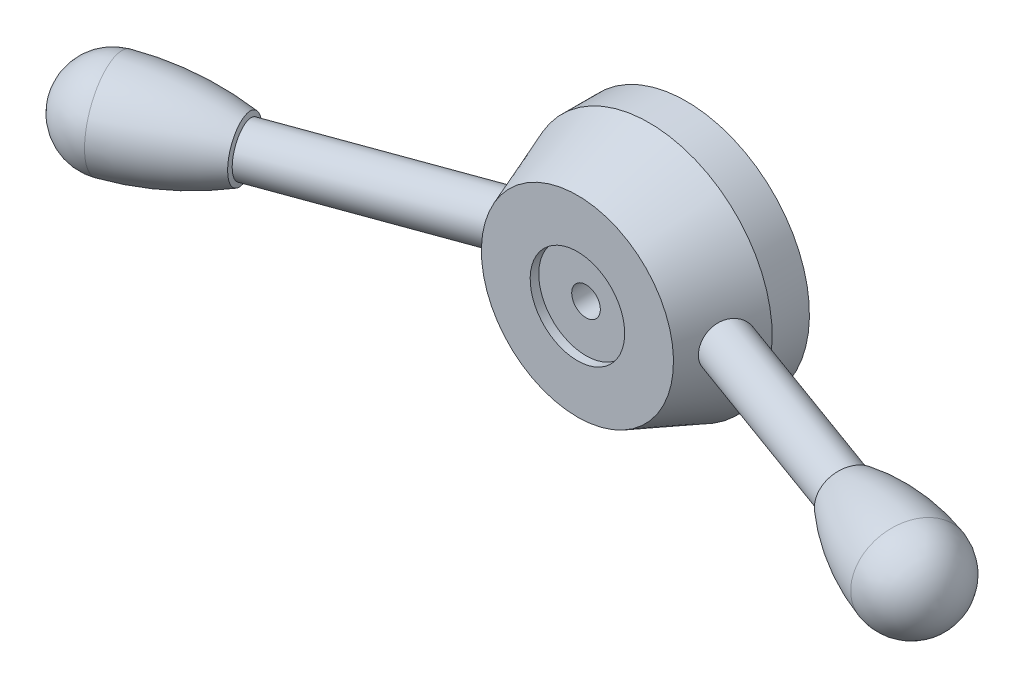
ISO-10303-21;
HEADER;
FILE_DESCRIPTION(('STEP AP214'),'2;1');
FILE_NAME('part.step','',(''),(''),'','','');
FILE_SCHEMA(('AUTOMOTIVE_DESIGN { 1 0 10303 214 1 1 1 1 }'));
ENDSEC;
DATA;
#1=APPLICATION_CONTEXT('core data for automotive mechanical design processes');
#2=APPLICATION_PROTOCOL_DEFINITION('international standard','automotive_design',2000,#1);
#3=PRODUCT_CONTEXT('',#1,'mechanical');
#4=PRODUCT('Part','Part','',(#3));
#5=PRODUCT_RELATED_PRODUCT_CATEGORY('part','',(#4));
#6=PRODUCT_DEFINITION_FORMATION('','',#4);
#7=PRODUCT_DEFINITION_CONTEXT('part definition',#1,'design');
#8=PRODUCT_DEFINITION('design','',#6,#7);
#9=PRODUCT_DEFINITION_SHAPE('','',#8);
#10=(LENGTH_UNIT() NAMED_UNIT(*) SI_UNIT(.MILLI.,.METRE.));
#11=(NAMED_UNIT(*) PLANE_ANGLE_UNIT() SI_UNIT($,.RADIAN.));
#12=(NAMED_UNIT(*) SI_UNIT($,.STERADIAN.) SOLID_ANGLE_UNIT());
#13=UNCERTAINTY_MEASURE_WITH_UNIT(LENGTH_MEASURE(1.E-05),#10,'distance_accuracy_value','');
#14=(GEOMETRIC_REPRESENTATION_CONTEXT(3) GLOBAL_UNCERTAINTY_ASSIGNED_CONTEXT((#13)) GLOBAL_UNIT_ASSIGNED_CONTEXT((#10,
#11,#12)) REPRESENTATION_CONTEXT('',''));
#15=CARTESIAN_POINT('',(0.,0.,0.));
#16=DIRECTION('',(0.,0.,1.));
#17=DIRECTION('',(1.,0.,0.));
#18=AXIS2_PLACEMENT_3D('',#15,#16,#17);
#19=CARTESIAN_POINT('',(0.,0.,16.));
#20=DIRECTION('',(0.,0.,-1.));
#21=DIRECTION('',(0.,1.,0.));
#22=AXIS2_PLACEMENT_3D('',#19,#20,#21);
#23=CONICAL_SURFACE('',#22,43.,0.361861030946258);
#24=CARTESIAN_POINT('',(40.556704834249,5.3394046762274,21.5301733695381));
#25=CARTESIAN_POINT('',(40.4836805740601,5.5071618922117,21.6635939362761));
#26=CARTESIAN_POINT('',(40.40788440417,5.6684953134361,21.803487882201));
#27=CARTESIAN_POINT('',(40.2516139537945,5.97734896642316,22.0954888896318));
#28=CARTESIAN_POINT('',(40.1711388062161,6.12486662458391,22.2475982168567));
#29=CARTESIAN_POINT('',(40.0064352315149,6.40509835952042,22.5631891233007));
#30=CARTESIAN_POINT('',(39.9222045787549,6.53780349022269,22.7266774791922));
#31=CARTESIAN_POINT('',(39.7509783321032,6.78743379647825,23.064042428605));
#32=CARTESIAN_POINT('',(39.663981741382,6.90435320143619,23.2379227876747));
#33=CARTESIAN_POINT('',(39.4882680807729,7.12148405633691,23.5949172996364));
#34=CARTESIAN_POINT('',(39.3995515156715,7.22170032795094,23.7780287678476));
#35=CARTESIAN_POINT('',(39.2213183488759,7.40476857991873,24.1524882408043));
#36=CARTESIAN_POINT('',(39.131801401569,7.48761263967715,24.3438399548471));
#37=CARTESIAN_POINT('',(38.9529989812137,7.63522668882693,24.7334362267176));
#38=CARTESIAN_POINT('',(38.8637134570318,7.7000010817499,24.9316790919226));
#39=CARTESIAN_POINT('',(38.6863291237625,7.81096110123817,25.333701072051));
#40=CARTESIAN_POINT('',(38.5982297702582,7.85715555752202,25.5374775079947));
#41=CARTESIAN_POINT('',(38.424873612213,7.93027225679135,25.9473360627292));
#42=CARTESIAN_POINT('',(38.339597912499,7.95737095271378,26.1533787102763));
#43=CARTESIAN_POINT('',(38.1718566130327,7.99275336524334,26.5681165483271));
#44=CARTESIAN_POINT('',(38.0893899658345,8.00104417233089,26.7768107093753));
#45=CARTESIAN_POINT('',(37.9279284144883,7.99874569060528,27.1954661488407));
#46=CARTESIAN_POINT('',(37.8489339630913,7.98815394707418,27.4054275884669));
#47=CARTESIAN_POINT('',(37.6950350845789,7.94815316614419,27.8250555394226));
#48=CARTESIAN_POINT('',(37.6201306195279,7.91874430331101,28.03472205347));
#49=CARTESIAN_POINT('',(37.4760058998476,7.84191781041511,28.4490403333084));
#50=CARTESIAN_POINT('',(37.4067168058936,7.79477929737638,28.6537199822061));
#51=CARTESIAN_POINT('',(37.2729230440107,7.68279977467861,29.0598573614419));
#52=CARTESIAN_POINT('',(37.2084200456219,7.61795262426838,29.2613139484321));
#53=CARTESIAN_POINT('',(37.0844940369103,7.47107254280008,29.6593839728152));
#54=CARTESIAN_POINT('',(37.0250693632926,7.38904526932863,29.8559989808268));
#55=CARTESIAN_POINT('',(36.9113939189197,7.20836471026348,30.2430740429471));
#56=CARTESIAN_POINT('',(36.8571449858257,7.10970555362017,30.4335318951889));
#57=CARTESIAN_POINT('',(36.7536280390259,6.89597157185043,30.8077261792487));
#58=CARTESIAN_POINT('',(36.7043856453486,6.78081892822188,30.9914252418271));
#59=CARTESIAN_POINT('',(36.6111286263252,6.53527913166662,31.3497452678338));
#60=CARTESIAN_POINT('',(36.5671140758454,6.40489176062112,31.5243661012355));
#61=CARTESIAN_POINT('',(36.4841688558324,6.12975103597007,31.8632593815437));
#62=CARTESIAN_POINT('',(36.4452394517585,5.98499412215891,32.0275292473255));
#63=CARTESIAN_POINT('',(36.3722926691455,5.68216817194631,32.3443790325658));
#64=CARTESIAN_POINT('',(36.338273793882,5.52410321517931,32.496962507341));
#65=CARTESIAN_POINT('',(36.2743543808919,5.19288009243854,32.7918078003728));
#66=CARTESIAN_POINT('',(36.2445336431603,5.01951110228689,32.9338501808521));
#67=CARTESIAN_POINT('',(36.1894274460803,4.66123567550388,33.2035297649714));
#68=CARTESIAN_POINT('',(36.1641419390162,4.47632936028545,33.3311671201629));
#69=CARTESIAN_POINT('',(36.1178107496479,4.09623111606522,33.5709744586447));
#70=CARTESIAN_POINT('',(36.096765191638,3.90103888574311,33.683143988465));
#71=CARTESIAN_POINT('',(36.0586258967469,3.50172003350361,33.8910380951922));
#72=CARTESIAN_POINT('',(36.0415320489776,3.29759366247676,33.9867631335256));
#73=CARTESIAN_POINT('',(36.0110129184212,2.88164823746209,34.1609885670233));
#74=CARTESIAN_POINT('',(35.997590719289,2.66982288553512,34.2394744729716));
#75=CARTESIAN_POINT('',(35.9742012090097,2.24022382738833,34.3783665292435));
#76=CARTESIAN_POINT('',(35.9642326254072,2.02245234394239,34.4387793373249));
#77=CARTESIAN_POINT('',(35.9475510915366,1.58244164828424,34.5409918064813));
#78=CARTESIAN_POINT('',(35.9408384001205,1.36020208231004,34.5827899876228));
#79=CARTESIAN_POINT('',(35.9305323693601,0.912904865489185,34.6473570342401));
#80=CARTESIAN_POINT('',(35.9269389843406,0.687847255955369,34.6701261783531));
#81=CARTESIAN_POINT('',(35.9228297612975,0.240377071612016,34.6961895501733));
#82=CARTESIAN_POINT('',(35.9222632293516,0.0179835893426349,34.6998045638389));
#83=CARTESIAN_POINT('',(35.9240599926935,-0.4263906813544,34.6883859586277));
#84=CARTESIAN_POINT('',(35.9264243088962,-0.648371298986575,34.6733458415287));
#85=CARTESIAN_POINT('',(35.9341321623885,-1.09015708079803,34.6247602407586));
#86=CARTESIAN_POINT('',(35.9394745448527,-1.30996305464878,34.5912219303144));
#87=CARTESIAN_POINT('',(35.9532480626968,-1.7460011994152,34.5059482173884));
#88=CARTESIAN_POINT('',(35.9616803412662,-1.96223201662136,34.4542060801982));
#89=CARTESIAN_POINT('',(35.9817426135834,-2.38840285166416,34.3333254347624));
#90=CARTESIAN_POINT('',(35.9933557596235,-2.59836972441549,34.2642787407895));
#91=CARTESIAN_POINT('',(36.0200031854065,-3.01174776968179,34.109275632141));
#92=CARTESIAN_POINT('',(36.0350375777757,-3.21515872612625,34.0233186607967));
#93=CARTESIAN_POINT('',(36.0687683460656,-3.61406209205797,33.835239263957));
#94=CARTESIAN_POINT('',(36.0874649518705,-3.80955400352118,33.7331158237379));
#95=CARTESIAN_POINT('',(36.1287840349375,-4.19131335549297,33.5135669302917));
#96=CARTESIAN_POINT('',(36.1514065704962,-4.37758065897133,33.3961412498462));
#97=CARTESIAN_POINT('',(36.2012307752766,-4.74243311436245,33.1450425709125));
#98=CARTESIAN_POINT('',(36.2284970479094,-4.92085768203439,33.0111490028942));
#99=CARTESIAN_POINT('',(36.2876452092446,-5.26573488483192,32.7296701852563));
#100=CARTESIAN_POINT('',(36.3195270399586,-5.4321876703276,32.5820851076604));
#101=CARTESIAN_POINT('',(36.388180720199,-5.7520394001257,32.2743563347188));
#102=CARTESIAN_POINT('',(36.4249537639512,-5.90543514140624,32.114209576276));
#103=CARTESIAN_POINT('',(36.503598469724,-6.19802566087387,31.7826960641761));
#104=CARTESIAN_POINT('',(36.5454683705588,-6.33722531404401,31.6113331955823));
#105=CARTESIAN_POINT('',(36.6349189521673,-6.60178118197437,31.2569564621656));
#106=CARTESIAN_POINT('',(36.6825507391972,-6.72699119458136,31.0738462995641));
#107=CARTESIAN_POINT('',(36.7832998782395,-6.96109057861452,30.6989115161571));
#108=CARTESIAN_POINT('',(36.8364171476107,-7.06998019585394,30.507087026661));
#109=CARTESIAN_POINT('',(36.9481438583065,-7.27061966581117,30.1162218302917));
#110=CARTESIAN_POINT('',(37.0067529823,-7.36237050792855,29.9171815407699));
#111=CARTESIAN_POINT('',(37.1293655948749,-7.52803258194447,29.5134244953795));
#112=CARTESIAN_POINT('',(37.1933688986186,-7.60194442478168,29.3087079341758));
#113=CARTESIAN_POINT('',(37.3257292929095,-7.73055286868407,28.8977381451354));
#114=CARTESIAN_POINT('',(37.3940227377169,-7.7854758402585,28.6915352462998));
#115=CARTESIAN_POINT('',(37.5353059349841,-7.87692113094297,28.2767598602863));
#116=CARTESIAN_POINT('',(37.6082939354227,-7.91345027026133,28.0681882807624));
#117=CARTESIAN_POINT('',(37.7585502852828,-7.96786327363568,27.6501302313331));
#118=CARTESIAN_POINT('',(37.8358191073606,-7.9857450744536,27.440643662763));
#119=CARTESIAN_POINT('',(37.9940695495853,-8.00272931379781,27.0223138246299));
#120=CARTESIAN_POINT('',(38.0750511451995,-8.00183187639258,26.8134705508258));
#121=CARTESIAN_POINT('',(38.2389665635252,-7.98142087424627,26.4006866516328));
#122=CARTESIAN_POINT('',(38.3218601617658,-7.96215476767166,26.1967177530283));
#123=CARTESIAN_POINT('',(38.4899229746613,-7.90552231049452,25.7921766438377));
#124=CARTESIAN_POINT('',(38.5750929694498,-7.86814967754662,25.5916056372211));
#125=CARTESIAN_POINT('',(38.7468604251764,-7.77561699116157,25.1953161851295));
#126=CARTESIAN_POINT('',(38.8334574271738,-7.72046255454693,24.9995962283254));
#127=CARTESIAN_POINT('',(39.0072899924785,-7.59276466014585,24.6141183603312));
#128=CARTESIAN_POINT('',(39.0945257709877,-7.52021505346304,24.4243625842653));
#129=CARTESIAN_POINT('',(39.2694007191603,-7.35764188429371,24.0505986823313));
#130=CARTESIAN_POINT('',(39.3570377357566,-7.26748657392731,23.8666468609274));
#131=CARTESIAN_POINT('',(39.5311043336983,-7.07072171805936,23.5071640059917));
#132=CARTESIAN_POINT('',(39.6175338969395,-6.96411192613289,23.3316330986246));
#133=CARTESIAN_POINT('',(39.78826780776,-6.73515855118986,22.9899844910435));
#134=CARTESIAN_POINT('',(39.8725716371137,-6.61281117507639,22.8238690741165));
#135=CARTESIAN_POINT('',(40.0380723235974,-6.35327877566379,22.5021050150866));
#136=CARTESIAN_POINT('',(40.1192701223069,-6.21609829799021,22.34645318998));
#137=CARTESIAN_POINT('',(40.2790259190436,-5.92531462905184,22.0438763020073));
#138=CARTESIAN_POINT('',(40.3575149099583,-5.77147045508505,21.8971463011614));
#139=CARTESIAN_POINT('',(40.5094192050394,-5.45040136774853,21.6162408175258));
#140=CARTESIAN_POINT('',(40.5828345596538,-5.28317658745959,21.4820652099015));
#141=CARTESIAN_POINT('',(40.7237001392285,-4.93647363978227,21.2270568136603));
#142=CARTESIAN_POINT('',(40.791150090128,-4.75699491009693,21.1062246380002));
#143=CARTESIAN_POINT('',(40.9192368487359,-4.38702092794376,20.8786430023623));
#144=CARTESIAN_POINT('',(40.9798738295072,-4.19652595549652,20.7718931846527));
#145=CARTESIAN_POINT('',(41.0936735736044,-3.8054423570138,20.5729357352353));
#146=CARTESIAN_POINT('',(41.146821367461,-3.60483457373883,20.4807571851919));
#147=CARTESIAN_POINT('',(41.2447846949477,-3.19535424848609,20.3118139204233));
#148=CARTESIAN_POINT('',(41.2896032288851,-2.98648471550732,20.2350436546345));
#149=CARTESIAN_POINT('',(41.3703336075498,-2.56188580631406,20.0973716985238));
#150=CARTESIAN_POINT('',(41.406244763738,-2.34615590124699,20.0364712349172));
#151=CARTESIAN_POINT('',(41.4686641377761,-1.90941788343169,19.9309557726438));
#152=CARTESIAN_POINT('',(41.4951724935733,-1.68840984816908,19.8863405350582));
#153=CARTESIAN_POINT('',(41.5380924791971,-1.24610286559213,19.8142478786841));
#154=CARTESIAN_POINT('',(41.5546502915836,-1.02485852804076,19.7865222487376));
#155=CARTESIAN_POINT('',(41.5780623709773,-0.580423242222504,19.7473511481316));
#156=CARTESIAN_POINT('',(41.5849166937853,-0.357232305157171,19.7359055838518));
#157=CARTESIAN_POINT('',(41.5888279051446,0.089496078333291,19.7293722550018));
#158=CARTESIAN_POINT('',(41.5858838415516,0.313033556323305,19.7342860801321));
#159=CARTESIAN_POINT('',(41.5702367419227,0.758804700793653,19.7604413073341));
#160=CARTESIAN_POINT('',(41.5575338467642,0.981038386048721,19.7816824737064));
#161=CARTESIAN_POINT('',(41.5227249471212,1.42030070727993,19.8400431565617));
#162=CARTESIAN_POINT('',(41.5007179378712,1.63735942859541,19.8769955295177));
#163=CARTESIAN_POINT('',(41.4476102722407,2.0670978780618,19.9665051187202));
#164=CARTESIAN_POINT('',(41.4165096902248,2.27977764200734,20.0190622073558));
#165=CARTESIAN_POINT('',(41.3456427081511,2.69915281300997,20.1394078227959));
#166=CARTESIAN_POINT('',(41.3058820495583,2.90585208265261,20.2071862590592));
#167=CARTESIAN_POINT('',(41.2182113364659,3.31194310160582,20.3575398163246));
#168=CARTESIAN_POINT('',(41.1703025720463,3.51133600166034,20.4401125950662));
#169=CARTESIAN_POINT('',(41.0405745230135,4.00095739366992,20.6653116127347));
#170=CARTESIAN_POINT('',(40.9539080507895,4.28575461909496,20.817110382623));
#171=CARTESIAN_POINT('',(40.7657326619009,4.83147855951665,21.1513188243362));
#172=CARTESIAN_POINT('',(40.6642233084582,5.09240457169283,21.3337293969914));
#173=CARTESIAN_POINT('',(40.556704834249,5.3394046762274,21.5301733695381));
#174=B_SPLINE_CURVE_WITH_KNOTS('',3,(#24,#25,#26,#27,#28,#29,#30,#31,#32,#33,#34,#35,#36,#37,
#38,#39,#40,#41,#42,#43,#44,#45,#46,#47,#48,#49,#50,#51,#52,#53,#54,#55,#56,#57,#58,#59,#60,#61,
#62,#63,#64,#65,#66,#67,#68,#69,#70,#71,#72,#73,#74,#75,#76,#77,#78,#79,#80,#81,#82,#83,#84,#85,
#86,#87,#88,#89,#90,#91,#92,#93,#94,#95,#96,#97,#98,#99,#100,#101,#102,#103,#104,#105,#106,#107,
#108,#109,#110,#111,#112,#113,#114,#115,#116,#117,#118,#119,#120,#121,#122,#123,#124,#125,#126,
#127,#128,#129,#130,#131,#132,#133,#134,#135,#136,#137,#138,#139,#140,#141,#142,#143,#144,#145,
#146,#147,#148,#149,#150,#151,#152,#153,#154,#155,#156,#157,#158,#159,#160,#161,#162,#163,#164,
#165,#166,#167,#168,#169,#170,#171,#172,#173),.UNSPECIFIED.,.T.,.F.,(4,2,2,2,2,2,2,2,2,2,2,2,2,
2,2,2,2,2,2,2,2,2,2,2,2,2,2,2,2,2,2,2,2,2,2,2,2,2,2,2,2,2,2,2,2,2,2,2,2,2,2,2,2,2,2,2,2,2,2,2,2,
2,2,2,2,2,2,2,2,2,2,2,2,2,4),(0.,0.679039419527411,1.35820508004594,2.03777873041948,
2.71760013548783,3.3972249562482,4.07715897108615,4.7569271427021,5.43637188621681,
6.10945288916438,6.78228010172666,7.45519478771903,8.12810323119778,8.79083369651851,
9.45379426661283,10.1165368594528,10.77951389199,11.4457288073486,12.1119532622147,
12.7783431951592,13.444529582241,14.1220356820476,14.7995346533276,15.4770534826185,
16.1545532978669,16.832620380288,17.5104373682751,18.1883082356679,18.8661691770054,
19.5326408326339,20.1993447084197,20.865790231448,21.532482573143,22.1957098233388,
22.858958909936,23.5222496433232,24.1855502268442,24.8589717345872,25.5323847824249,
26.2059625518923,26.8793082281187,27.5591374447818,28.2389564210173,28.9187361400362,
29.5984925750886,30.2698409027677,30.9409401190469,31.6121135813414,32.283282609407,
32.9455357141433,33.6080187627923,34.2702927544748,34.932801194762,35.6004717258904,
36.2681522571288,36.9359940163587,37.6036316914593,38.2827011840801,38.9617639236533,
39.6408578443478,40.3199345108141,41.0003498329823,41.6805195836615,42.3607418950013,
43.0409542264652,43.7109124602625,44.3808668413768,45.05088632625,45.7208961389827,
46.3839497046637,47.0469978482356,47.7096077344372,48.3721128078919,49.3718782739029,
50.3716731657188),.UNSPECIFIED.);
#175=CARTESIAN_POINT('',(40.556704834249,5.3394046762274,21.5301733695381));
#176=VERTEX_POINT('',#175);
#177=EDGE_CURVE('E24',#176,#176,#174,.T.);
#178=ORIENTED_EDGE('',*,*,#177,.F.);
#179=EDGE_LOOP('',(#178));
#180=FACE_BOUND('',#179,.T.);
#181=CARTESIAN_POINT('',(0.,0.,41.));
#182=DIRECTION('',(0.,0.,1.));
#183=DIRECTION('',(0.,-1.,0.));
#184=AXIS2_PLACEMENT_3D('',#181,#182,#183);
#185=CIRCLE('',#184,33.5367739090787);
#186=CARTESIAN_POINT('',(0.,-33.5367739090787,41.));
#187=VERTEX_POINT('',#186);
#188=EDGE_CURVE('E105',#187,#187,#185,.T.);
#189=ORIENTED_EDGE('',*,*,#188,.F.);
#190=EDGE_LOOP('',(#189));
#191=FACE_BOUND('',#190,.T.);
#192=CARTESIAN_POINT('',(0.,0.,16.));
#193=DIRECTION('',(0.,0.,1.));
#194=DIRECTION('',(0.,-1.,0.));
#195=AXIS2_PLACEMENT_3D('',#192,#193,#194);
#196=CIRCLE('',#195,43.);
#197=CARTESIAN_POINT('',(0.,-43.,16.));
#198=VERTEX_POINT('',#197);
#199=EDGE_CURVE('E109',#198,#198,#196,.T.);
#200=ORIENTED_EDGE('',*,*,#199,.T.);
#201=EDGE_LOOP('',(#200));
#202=FACE_BOUND('',#201,.T.);
#203=CARTESIAN_POINT('',(-40.6109020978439,5.60848954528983,21.2932591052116));
#204=CARTESIAN_POINT('',(-40.6877675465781,5.43547274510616,21.1546371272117));
#205=CARTESIAN_POINT('',(-40.7617594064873,5.25590688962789,21.0226965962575));
#206=CARTESIAN_POINT('',(-40.9031561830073,4.88474613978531,20.772827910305));
#207=CARTESIAN_POINT('',(-40.9705601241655,4.69314947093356,20.6549018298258));
#208=CARTESIAN_POINT('',(-41.0979465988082,4.2991439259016,20.4337474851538));
#209=CARTESIAN_POINT('',(-41.1579245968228,4.09672854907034,20.3305281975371));
#210=CARTESIAN_POINT('',(-41.2696427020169,3.68256776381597,20.1395003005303));
#211=CARTESIAN_POINT('',(-41.3213829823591,3.47082255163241,20.0516913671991));
#212=CARTESIAN_POINT('',(-41.4159670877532,3.03936523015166,19.8920005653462));
#213=CARTESIAN_POINT('',(-41.458806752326,2.81964945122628,19.8201261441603));
#214=CARTESIAN_POINT('',(-41.5349832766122,2.37389185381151,19.6928228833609));
#215=CARTESIAN_POINT('',(-41.5683200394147,2.14784997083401,19.6373942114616));
#216=CARTESIAN_POINT('',(-41.6250271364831,1.69111334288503,19.543363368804));
#217=CARTESIAN_POINT('',(-41.6483995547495,1.46041958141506,19.5047576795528));
#218=CARTESIAN_POINT('',(-41.684862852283,0.996014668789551,19.4446192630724));
#219=CARTESIAN_POINT('',(-41.6979538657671,0.762303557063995,19.4230863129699));
#220=CARTESIAN_POINT('',(-41.713570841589,0.296578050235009,19.3974062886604));
#221=CARTESIAN_POINT('',(-41.7162296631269,0.0645801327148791,19.3930405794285));
#222=CARTESIAN_POINT('',(-41.7113113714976,-0.399099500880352,19.4011231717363));
#223=CARTESIAN_POINT('',(-41.7037305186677,-0.630781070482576,19.4135776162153));
#224=CARTESIAN_POINT('',(-41.6784328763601,-1.09202820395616,19.455222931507));
#225=CARTESIAN_POINT('',(-41.6607181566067,-1.32159419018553,19.4844103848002));
#226=CARTESIAN_POINT('',(-41.6153952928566,-1.77702488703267,19.5593245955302));
#227=CARTESIAN_POINT('',(-41.5877869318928,-2.00288951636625,19.6050517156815));
#228=CARTESIAN_POINT('',(-41.523204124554,-2.44824858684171,19.7124858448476));
#229=CARTESIAN_POINT('',(-41.4862751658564,-2.66776835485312,19.7741152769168));
#230=CARTESIAN_POINT('',(-41.4034712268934,-3.10005273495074,19.9130654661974));
#231=CARTESIAN_POINT('',(-41.357596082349,-3.31281722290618,19.9903865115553));
#232=CARTESIAN_POINT('',(-41.2574966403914,-3.73012500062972,20.1602300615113));
#233=CARTESIAN_POINT('',(-41.2032732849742,-3.93466921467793,20.2527508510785));
#234=CARTESIAN_POINT('',(-41.0871378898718,-4.33426914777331,20.4524750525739));
#235=CARTESIAN_POINT('',(-41.0252233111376,-4.52932170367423,20.5596833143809));
#236=CARTESIAN_POINT('',(-40.8935713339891,-4.9112314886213,20.7897224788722));
#237=CARTESIAN_POINT('',(-40.8237370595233,-5.09793689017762,20.9127500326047));
#238=CARTESIAN_POINT('',(-40.6778255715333,-5.4589661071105,21.1725084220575));
#239=CARTESIAN_POINT('',(-40.6017482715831,-5.63328975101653,21.309239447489));
#240=CARTESIAN_POINT('',(-40.4442511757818,-5.96844082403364,21.5956517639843));
#241=CARTESIAN_POINT('',(-40.3628300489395,-6.12926486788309,21.7453362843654));
#242=CARTESIAN_POINT('',(-40.195652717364,-6.43624907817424,22.056722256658));
#243=CARTESIAN_POINT('',(-40.1098978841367,-6.58241384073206,22.218419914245));
#244=CARTESIAN_POINT('',(-39.9337349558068,-6.86119151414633,22.5554169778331));
#245=CARTESIAN_POINT('',(-39.8432769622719,-6.99357340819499,22.730881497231));
#246=CARTESIAN_POINT('',(-39.6599548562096,-7.24134623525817,23.0922375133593));
#247=CARTESIAN_POINT('',(-39.567090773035,-7.35673737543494,23.2781288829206));
#248=CARTESIAN_POINT('',(-39.3800185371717,-7.56969128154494,23.6592193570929));
#249=CARTESIAN_POINT('',(-39.285810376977,-7.66725394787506,23.8544185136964));
#250=CARTESIAN_POINT('',(-39.097108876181,-7.84381053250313,24.252903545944));
#251=CARTESIAN_POINT('',(-39.0026155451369,-7.92280506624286,24.4561891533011));
#252=CARTESIAN_POINT('',(-38.8148622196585,-8.06124622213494,24.8684638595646));
#253=CARTESIAN_POINT('',(-38.721598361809,-8.12079274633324,25.0774176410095));
#254=CARTESIAN_POINT('',(-38.536808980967,-8.22039818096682,25.5005761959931));
#255=CARTESIAN_POINT('',(-38.4452828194,-8.26046438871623,25.7147789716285));
#256=CARTESIAN_POINT('',(-38.264833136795,-8.32080239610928,26.1470535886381));
#257=CARTESIAN_POINT('',(-38.1759097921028,-8.34107285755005,26.3651256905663));
#258=CARTESIAN_POINT('',(-38.0014961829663,-8.36162638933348,26.8035718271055));
#259=CARTESIAN_POINT('',(-37.9160058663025,-8.36190976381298,27.0239458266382));
#260=CARTESIAN_POINT('',(-37.7507713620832,-8.34265218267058,27.4611666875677));
#261=CARTESIAN_POINT('',(-37.6709486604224,-8.3234893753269,27.6780006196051));
#262=CARTESIAN_POINT('',(-37.5158414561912,-8.26603504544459,28.1108427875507));
#263=CARTESIAN_POINT('',(-37.4405585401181,-8.22773687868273,28.3268507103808));
#264=CARTESIAN_POINT('',(-37.2950280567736,-8.13230773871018,28.7563311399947));
#265=CARTESIAN_POINT('',(-37.2247793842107,-8.07518091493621,28.9698041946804));
#266=CARTESIAN_POINT('',(-37.0896212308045,-7.9425255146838,29.3926897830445));
#267=CARTESIAN_POINT('',(-37.0247119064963,-7.86699639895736,29.6021021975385));
#268=CARTESIAN_POINT('',(-36.9007128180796,-7.6984869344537,30.0143752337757));
#269=CARTESIAN_POINT('',(-36.8415982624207,-7.60558636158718,30.2172610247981));
#270=CARTESIAN_POINT('',(-36.7289380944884,-7.40279425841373,30.6159655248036));
#271=CARTESIAN_POINT('',(-36.6753925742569,-7.29290244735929,30.8117841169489));
#272=CARTESIAN_POINT('',(-36.5738401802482,-7.05690456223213,31.1949207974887));
#273=CARTESIAN_POINT('',(-36.5258337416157,-6.93079721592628,31.3822382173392));
#274=CARTESIAN_POINT('',(-36.4352440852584,-6.66324902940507,31.7469733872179));
#275=CARTESIAN_POINT('',(-36.392660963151,-6.52180791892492,31.9243909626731));
#276=CARTESIAN_POINT('',(-36.3120500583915,-6.22204281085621,32.2708997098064));
#277=CARTESIAN_POINT('',(-36.2741110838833,-6.06347457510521,32.4398003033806));
#278=CARTESIAN_POINT('',(-36.2033750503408,-5.73255795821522,32.764678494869));
#279=CARTESIAN_POINT('',(-36.1705779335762,-5.56020973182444,32.9206562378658));
#280=CARTESIAN_POINT('',(-36.1098149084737,-5.20287298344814,33.2184668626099));
#281=CARTESIAN_POINT('',(-36.0818494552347,-5.01788327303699,33.3602984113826));
#282=CARTESIAN_POINT('',(-36.0304252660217,-4.63652057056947,33.6286386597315));
#283=CARTESIAN_POINT('',(-36.0069664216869,-4.44014785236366,33.7551477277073));
#284=CARTESIAN_POINT('',(-35.9639909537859,-4.03515401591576,33.9930601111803));
#285=CARTESIAN_POINT('',(-35.9445196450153,-3.82642351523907,34.1042855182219));
#286=CARTESIAN_POINT('',(-35.9095180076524,-3.40019634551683,34.3089654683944));
#287=CARTESIAN_POINT('',(-35.8939862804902,-3.18270281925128,34.4024263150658));
#288=CARTESIAN_POINT('',(-35.8665550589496,-2.74039282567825,34.5707689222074));
#289=CARTESIAN_POINT('',(-35.854655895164,-2.51557569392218,34.6456489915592));
#290=CARTESIAN_POINT('',(-35.8342383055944,-2.06025748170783,34.7760996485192));
#291=CARTESIAN_POINT('',(-35.8257198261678,-1.82975649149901,34.8316705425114));
#292=CARTESIAN_POINT('',(-35.8119619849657,-1.3679496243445,34.9223292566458));
#293=CARTESIAN_POINT('',(-35.8066792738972,-1.1366980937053,34.9576874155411));
#294=CARTESIAN_POINT('',(-35.7990860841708,-0.67198702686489,35.0087402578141));
#295=CARTESIAN_POINT('',(-35.7967755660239,-0.438527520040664,35.0244352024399));
#296=CARTESIAN_POINT('',(-35.7950702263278,0.0288746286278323,35.0360054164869));
#297=CARTESIAN_POINT('',(-35.7956751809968,0.262817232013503,35.0318822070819));
#298=CARTESIAN_POINT('',(-35.7998151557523,0.729487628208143,35.0038606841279));
#299=CARTESIAN_POINT('',(-35.8033501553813,0.962215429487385,34.9799625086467));
#300=CARTESIAN_POINT('',(-35.8133629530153,1.42141890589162,34.9131151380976));
#301=CARTESIAN_POINT('',(-35.8197975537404,1.64793633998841,34.8704458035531));
#302=CARTESIAN_POINT('',(-35.8357440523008,2.09663497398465,34.7665163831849));
#303=CARTESIAN_POINT('',(-35.845256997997,2.31881466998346,34.7052499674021));
#304=CARTESIAN_POINT('',(-35.8675597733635,2.75719749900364,34.5647072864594));
#305=CARTESIAN_POINT('',(-35.880349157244,2.97340144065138,34.4854334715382));
#306=CARTESIAN_POINT('',(-35.9094548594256,3.39841262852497,34.3095783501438));
#307=CARTESIAN_POINT('',(-35.9257713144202,3.60721958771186,34.2129963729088));
#308=CARTESIAN_POINT('',(-35.9623951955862,4.018057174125,34.0023300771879));
#309=CARTESIAN_POINT('',(-35.9827402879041,4.220000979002,33.8880829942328));
#310=CARTESIAN_POINT('',(-36.0276349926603,4.6135879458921,33.6437611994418));
#311=CARTESIAN_POINT('',(-36.0521847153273,4.80523083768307,33.5136860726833));
#312=CARTESIAN_POINT('',(-36.1058164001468,5.17696533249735,33.2387657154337));
#313=CARTESIAN_POINT('',(-36.1348987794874,5.35705587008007,33.0939191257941));
#314=CARTESIAN_POINT('',(-36.197911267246,5.70448041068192,32.7906197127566));
#315=CARTESIAN_POINT('',(-36.2318414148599,5.87181431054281,32.6321667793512));
#316=CARTESIAN_POINT('',(-36.3054671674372,6.19536736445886,32.300058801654));
#317=CARTESIAN_POINT('',(-36.3452517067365,6.35134655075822,32.126189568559));
#318=CARTESIAN_POINT('',(-36.4303945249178,6.64786143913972,31.7670246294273));
#319=CARTESIAN_POINT('',(-36.4757527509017,6.78839728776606,31.5817290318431));
#320=CARTESIAN_POINT('',(-36.5722315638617,7.05301977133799,31.2011585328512));
#321=CARTESIAN_POINT('',(-36.6233521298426,7.17710646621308,31.0058836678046));
#322=CARTESIAN_POINT('',(-36.7314524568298,7.40791067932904,30.6068809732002));
#323=CARTESIAN_POINT('',(-36.7884319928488,7.51462886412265,30.4031534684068));
#324=CARTESIAN_POINT('',(-36.9079638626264,7.70943699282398,29.9897851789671));
#325=CARTESIAN_POINT('',(-36.9704890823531,7.79761115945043,29.7801762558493));
#326=CARTESIAN_POINT('',(-37.1011823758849,7.95524411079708,29.3558367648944));
#327=CARTESIAN_POINT('',(-37.1693483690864,8.02470975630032,29.1411081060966));
#328=CARTESIAN_POINT('',(-37.3110858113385,8.1444262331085,28.7080926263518));
#329=CARTESIAN_POINT('',(-37.3846575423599,8.19467606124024,28.4898056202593));
#330=CARTESIAN_POINT('',(-37.5368072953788,8.27555981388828,28.0513514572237));
#331=CARTESIAN_POINT('',(-37.6153852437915,8.30619402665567,27.8311843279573));
#332=CARTESIAN_POINT('',(-37.7755249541,8.34723061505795,27.3947009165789));
#333=CARTESIAN_POINT('',(-37.8570047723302,8.35799630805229,27.1783886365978));
#334=CARTESIAN_POINT('',(-38.0236636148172,8.36034004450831,26.747088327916));
#335=CARTESIAN_POINT('',(-38.1088426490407,8.35191803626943,26.5321003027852));
#336=CARTESIAN_POINT('',(-38.2821926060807,8.31597078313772,26.104914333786));
#337=CARTESIAN_POINT('',(-38.3703639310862,8.2884429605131,25.89271677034));
#338=CARTESIAN_POINT('',(-38.5488816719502,8.21451644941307,25.4725698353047));
#339=CARTESIAN_POINT('',(-38.6392280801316,8.16811782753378,25.2646204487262));
#340=CARTESIAN_POINT('',(-38.8211530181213,8.05686334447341,24.8544737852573));
#341=CARTESIAN_POINT('',(-38.9127305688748,7.99202140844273,24.6522722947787));
#342=CARTESIAN_POINT('',(-39.0962595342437,7.84436390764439,24.2547228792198));
#343=CARTESIAN_POINT('',(-39.1882109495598,7.76154830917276,24.0593749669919));
#344=CARTESIAN_POINT('',(-39.3714840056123,7.57859397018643,23.6768060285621));
#345=CARTESIAN_POINT('',(-39.4628059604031,7.47846463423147,23.4895806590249));
#346=CARTESIAN_POINT('',(-39.6438689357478,7.26159934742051,23.1242870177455));
#347=CARTESIAN_POINT('',(-39.7336101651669,7.14486560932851,22.9462175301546));
#348=CARTESIAN_POINT('',(-39.962471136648,6.82239918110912,22.4986899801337));
#349=CARTESIAN_POINT('',(-40.0997041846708,6.604603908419,22.2368385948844));
#350=CARTESIAN_POINT('',(-40.3639264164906,6.13268900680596,21.742317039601));
#351=CARTESIAN_POINT('',(-40.4909153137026,5.878568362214,21.5096476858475));
#352=CARTESIAN_POINT('',(-40.6109020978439,5.60848954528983,21.2932591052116));
#353=B_SPLINE_CURVE_WITH_KNOTS('',3,(#203,#204,#205,#206,#207,#208,#209,#210,#211,#212,#213,
#214,#215,#216,#217,#218,#219,#220,#221,#222,#223,#224,#225,#226,#227,#228,#229,#230,#231,#232,
#233,#234,#235,#236,#237,#238,#239,#240,#241,#242,#243,#244,#245,#246,#247,#248,#249,#250,#251,
#252,#253,#254,#255,#256,#257,#258,#259,#260,#261,#262,#263,#264,#265,#266,#267,#268,#269,#270,
#271,#272,#273,#274,#275,#276,#277,#278,#279,#280,#281,#282,#283,#284,#285,#286,#287,#288,#289,
#290,#291,#292,#293,#294,#295,#296,#297,#298,#299,#300,#301,#302,#303,#304,#305,#306,#307,#308,
#309,#310,#311,#312,#313,#314,#315,#316,#317,#318,#319,#320,#321,#322,#323,#324,#325,#326,#327,
#328,#329,#330,#331,#332,#333,#334,#335,#336,#337,#338,#339,#340,#341,#342,#343,#344,#345,#346,
#347,#348,#349,#350,#351,#352),.UNSPECIFIED.,.T.,.F.,(4,2,2,2,2,2,2,2,2,2,2,2,2,2,2,2,2,2,2,2,2,
2,2,2,2,2,2,2,2,2,2,2,2,2,2,2,2,2,2,2,2,2,2,2,2,2,2,2,2,2,2,2,2,2,2,2,2,2,2,2,2,2,2,2,2,2,2,2,2,
2,2,2,2,2,4),(0.,0.70363324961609,1.4073705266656,2.11153552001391,2.81568570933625,
3.52016430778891,4.22465009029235,4.92898846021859,5.63331763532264,6.32864713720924,
7.02423065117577,7.71967215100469,8.41512890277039,9.10725508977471,9.79939398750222,
10.4914548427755,11.1837447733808,11.8856690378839,12.5876030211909,13.2897125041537,
13.9916011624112,14.7038162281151,15.4160226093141,16.1282329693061,16.8404197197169,
17.5488883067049,18.2570912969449,18.9653421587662,19.6735822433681,20.3683089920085,
21.0632771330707,21.7580922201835,22.4529276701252,23.144647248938,23.8363782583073,
24.5281635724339,25.2199610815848,25.9234108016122,26.6268526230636,27.3303606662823,
28.0338517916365,28.7449410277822,29.455777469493,30.1666785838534,30.8775684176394,
31.5787134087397,32.2798490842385,32.9809309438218,33.6820079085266,34.3729691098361,
35.0641657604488,35.7552684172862,36.4463978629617,37.1443232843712,37.8422670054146,
38.5402750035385,39.2382886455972,39.948278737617,40.6582620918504,41.3682428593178,
42.0781963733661,42.784852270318,43.4912486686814,44.1976819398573,44.9041048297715,
45.5974769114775,46.2908508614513,46.9843183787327,47.6777834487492,48.3707263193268,
49.0636704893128,49.7562394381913,50.4487161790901,51.5470553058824,52.6454251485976),.UNSPECIFIED.);
#354=CARTESIAN_POINT('',(-40.6109020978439,5.60848954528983,21.2932591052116));
#355=VERTEX_POINT('',#354);
#356=EDGE_CURVE('E8',#355,#355,#353,.T.);
#357=ORIENTED_EDGE('',*,*,#356,.F.);
#358=EDGE_LOOP('',(#357));
#359=FACE_BOUND('',#358,.T.);
#360=ADVANCED_FACE('F12',(#180,#191,#202,#359),#23,.T.);
#361=CARTESIAN_POINT('',(0.,0.,67.6284115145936));
#362=DIRECTION('',(0.,0.,1.));
#363=DIRECTION('',(0.,-1.,0.));
#364=AXIS2_PLACEMENT_3D('',#361,#362,#363);
#365=CYLINDRICAL_SURFACE('',#364,17.5);
#366=CARTESIAN_POINT('',(0.,0.,3.));
#367=DIRECTION('',(0.,0.,1.));
#368=DIRECTION('',(0.,-1.,0.));
#369=AXIS2_PLACEMENT_3D('',#366,#367,#368);
#370=CIRCLE('',#369,17.5);
#371=CARTESIAN_POINT('',(0.,-17.5,3.));
#372=VERTEX_POINT('',#371);
#373=EDGE_CURVE('E28',#372,#372,#370,.T.);
#374=ORIENTED_EDGE('',*,*,#373,.F.);
#375=EDGE_LOOP('',(#374));
#376=FACE_BOUND('',#375,.T.);
#377=CARTESIAN_POINT('',(0.,0.,1.));
#378=DIRECTION('',(0.,0.,1.));
#379=DIRECTION('',(0.,-1.,0.));
#380=AXIS2_PLACEMENT_3D('',#377,#378,#379);
#381=CIRCLE('',#380,17.5);
#382=CARTESIAN_POINT('',(0.,-17.5,1.));
#383=VERTEX_POINT('',#382);
#384=EDGE_CURVE('E129',#383,#383,#381,.T.);
#385=ORIENTED_EDGE('',*,*,#384,.T.);
#386=EDGE_LOOP('',(#385));
#387=FACE_BOUND('',#386,.T.);
#388=ADVANCED_FACE('F14',(#376,#387),#365,.T.);
#389=CARTESIAN_POINT('',(43.,0.,3.));
#390=DIRECTION('',(0.,0.,-1.));
#391=DIRECTION('',(0.,1.,0.));
#392=AXIS2_PLACEMENT_3D('',#389,#390,#391);
#393=PLANE('',#392);
#394=ORIENTED_EDGE('',*,*,#373,.T.);
#395=EDGE_LOOP('',(#394));
#396=FACE_BOUND('',#395,.T.);
#397=CARTESIAN_POINT('',(0.,0.,3.));
#398=DIRECTION('',(0.,0.,1.));
#399=DIRECTION('',(0.,-1.,0.));
#400=AXIS2_PLACEMENT_3D('',#397,#398,#399);
#401=CIRCLE('',#400,43.);
#402=CARTESIAN_POINT('',(0.,-43.,3.));
#403=VERTEX_POINT('',#402);
#404=EDGE_CURVE('E32',#403,#403,#401,.T.);
#405=ORIENTED_EDGE('',*,*,#404,.F.);
#406=EDGE_LOOP('',(#405));
#407=FACE_BOUND('',#406,.T.);
#408=ADVANCED_FACE('F90',(#396,#407),#393,.T.);
#409=CARTESIAN_POINT('',(0.,0.,67.6284115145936));
#410=DIRECTION('',(0.,0.,1.));
#411=DIRECTION('',(0.,-1.,0.));
#412=AXIS2_PLACEMENT_3D('',#409,#410,#411);
#413=CYLINDRICAL_SURFACE('',#412,43.);
#414=ORIENTED_EDGE('',*,*,#199,.F.);
#415=EDGE_LOOP('',(#414));
#416=FACE_BOUND('',#415,.T.);
#417=ORIENTED_EDGE('',*,*,#404,.T.);
#418=EDGE_LOOP('',(#417));
#419=FACE_BOUND('',#418,.T.);
#420=ADVANCED_FACE('F83',(#416,#419),#413,.T.);
#421=CARTESIAN_POINT('',(33.5367739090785,0.,41.));
#422=DIRECTION('',(0.,0.,-1.));
#423=DIRECTION('',(0.,1.,0.));
#424=AXIS2_PLACEMENT_3D('',#421,#422,#423);
#425=PLANE('',#424);
#426=CARTESIAN_POINT('',(0.,0.,41.));
#427=DIRECTION('',(0.,0.,1.));
#428=DIRECTION('',(0.,-1.,0.));
#429=AXIS2_PLACEMENT_3D('',#426,#427,#428);
#430=CIRCLE('',#429,16.5);
#431=CARTESIAN_POINT('',(0.,-16.5,41.));
#432=VERTEX_POINT('',#431);
#433=EDGE_CURVE('E112',#432,#432,#430,.T.);
#434=ORIENTED_EDGE('',*,*,#433,.F.);
#435=EDGE_LOOP('',(#434));
#436=FACE_BOUND('',#435,.T.);
#437=ORIENTED_EDGE('',*,*,#188,.T.);
#438=EDGE_LOOP('',(#437));
#439=FACE_BOUND('',#438,.T.);
#440=ADVANCED_FACE('F80',(#436,#439),#425,.F.);
#441=CARTESIAN_POINT('',(0.,0.,67.6284115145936));
#442=DIRECTION('',(0.,0.,1.));
#443=DIRECTION('',(0.,-1.,0.));
#444=AXIS2_PLACEMENT_3D('',#441,#442,#443);
#445=CYLINDRICAL_SURFACE('',#444,16.5);
#446=ORIENTED_EDGE('',*,*,#433,.T.);
#447=EDGE_LOOP('',(#446));
#448=FACE_BOUND('',#447,.T.);
#449=CARTESIAN_POINT('',(0.,0.,38.));
#450=DIRECTION('',(0.,0.,1.));
#451=DIRECTION('',(0.,-1.,0.));
#452=AXIS2_PLACEMENT_3D('',#449,#450,#451);
#453=CIRCLE('',#452,16.5);
#454=CARTESIAN_POINT('',(0.,-16.5,38.));
#455=VERTEX_POINT('',#454);
#456=EDGE_CURVE('E117',#455,#455,#453,.T.);
#457=ORIENTED_EDGE('',*,*,#456,.F.);
#458=EDGE_LOOP('',(#457));
#459=FACE_BOUND('',#458,.T.);
#460=ADVANCED_FACE('F77',(#448,#459),#445,.F.);
#461=CARTESIAN_POINT('',(16.5,0.,38.));
#462=DIRECTION('',(0.,0.,-1.));
#463=DIRECTION('',(0.,1.,0.));
#464=AXIS2_PLACEMENT_3D('',#461,#462,#463);
#465=PLANE('',#464);
#466=CARTESIAN_POINT('',(0.,0.,38.));
#467=DIRECTION('',(0.,0.,1.));
#468=DIRECTION('',(0.,-1.,0.));
#469=AXIS2_PLACEMENT_3D('',#466,#467,#468);
#470=CIRCLE('',#469,5.);
#471=CARTESIAN_POINT('',(0.,-5.,38.));
#472=VERTEX_POINT('',#471);
#473=EDGE_CURVE('E120',#472,#472,#470,.T.);
#474=ORIENTED_EDGE('',*,*,#473,.F.);
#475=EDGE_LOOP('',(#474));
#476=FACE_BOUND('',#475,.T.);
#477=ORIENTED_EDGE('',*,*,#456,.T.);
#478=EDGE_LOOP('',(#477));
#479=FACE_BOUND('',#478,.T.);
#480=ADVANCED_FACE('F73',(#476,#479),#465,.F.);
#481=CARTESIAN_POINT('',(0.,0.,67.6284115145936));
#482=DIRECTION('',(0.,0.,1.));
#483=DIRECTION('',(0.,-1.,0.));
#484=AXIS2_PLACEMENT_3D('',#481,#482,#483);
#485=CYLINDRICAL_SURFACE('',#484,5.);
#486=CARTESIAN_POINT('',(0.,0.,0.));
#487=DIRECTION('',(0.,0.,1.));
#488=DIRECTION('',(0.,-1.,0.));
#489=AXIS2_PLACEMENT_3D('',#486,#487,#488);
#490=CIRCLE('',#489,5.);
#491=CARTESIAN_POINT('',(0.,-5.,0.));
#492=VERTEX_POINT('',#491);
#493=EDGE_CURVE('E123',#492,#492,#490,.T.);
#494=ORIENTED_EDGE('',*,*,#493,.F.);
#495=EDGE_LOOP('',(#494));
#496=FACE_BOUND('',#495,.T.);
#497=ORIENTED_EDGE('',*,*,#473,.T.);
#498=EDGE_LOOP('',(#497));
#499=FACE_BOUND('',#498,.T.);
#500=ADVANCED_FACE('F69',(#496,#499),#485,.F.);
#501=CARTESIAN_POINT('',(16.5,0.,0.));
#502=DIRECTION('',(0.,0.,-1.));
#503=DIRECTION('',(0.,1.,0.));
#504=AXIS2_PLACEMENT_3D('',#501,#502,#503);
#505=PLANE('',#504);
#506=ORIENTED_EDGE('',*,*,#493,.T.);
#507=EDGE_LOOP('',(#506));
#508=FACE_BOUND('',#507,.T.);
#509=CARTESIAN_POINT('',(0.,0.,0.));
#510=DIRECTION('',(0.,0.,1.));
#511=DIRECTION('',(0.,-1.,0.));
#512=AXIS2_PLACEMENT_3D('',#509,#510,#511);
#513=CIRCLE('',#512,16.5);
#514=CARTESIAN_POINT('',(0.,-16.5,0.));
#515=VERTEX_POINT('',#514);
#516=EDGE_CURVE('E126',#515,#515,#513,.T.);
#517=ORIENTED_EDGE('',*,*,#516,.F.);
#518=EDGE_LOOP('',(#517));
#519=FACE_BOUND('',#518,.T.);
#520=ADVANCED_FACE('F65',(#508,#519),#505,.T.);
#521=CARTESIAN_POINT('',(0.,0.,1.));
#522=DIRECTION('',(0.,0.,1.));
#523=DIRECTION('',(0.,-1.,0.));
#524=AXIS2_PLACEMENT_3D('',#521,#522,#523);
#525=CONICAL_SURFACE('',#524,17.5,0.785398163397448);
#526=ORIENTED_EDGE('',*,*,#516,.T.);
#527=EDGE_LOOP('',(#526));
#528=FACE_BOUND('',#527,.T.);
#529=ORIENTED_EDGE('',*,*,#384,.F.);
#530=EDGE_LOOP('',(#529));
#531=FACE_BOUND('',#530,.T.);
#532=ADVANCED_FACE('F47',(#528,#531),#525,.T.);
#533=CARTESIAN_POINT('',(31.157280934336,0.,24.4488082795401));
#534=DIRECTION('',(-0.939692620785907,0.,-0.342020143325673));
#535=DIRECTION('',(0.342020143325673,0.,-0.939692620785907));
#536=AXIS2_PLACEMENT_3D('',#533,#534,#535);
#537=CYLINDRICAL_SURFACE('',#536,7.99999999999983);
#538=CARTESIAN_POINT('',(105.150040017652,0.,51.3799701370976));
#539=DIRECTION('',(-0.939692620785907,0.,-0.342020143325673));
#540=DIRECTION('',(0.342020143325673,0.,-0.939692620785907));
#541=AXIS2_PLACEMENT_3D('',#538,#539,#540);
#542=CIRCLE('',#541,7.99999999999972);
#543=CARTESIAN_POINT('',(107.886201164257,0.,43.8624291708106));
#544=VERTEX_POINT('',#543);
#545=EDGE_CURVE('E138',#544,#544,#542,.T.);
#546=ORIENTED_EDGE('',*,*,#545,.T.);
#547=EDGE_LOOP('',(#546));
#548=FACE_BOUND('',#547,.T.);
#549=ORIENTED_EDGE('',*,*,#177,.T.);
#550=EDGE_LOOP('',(#549));
#551=FACE_BOUND('',#550,.T.);
#552=ADVANCED_FACE('F42',(#548,#551),#537,.T.);
#553=CARTESIAN_POINT('',(139.377120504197,0.,63.8376086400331));
#554=DIRECTION('',(0.,-1.,0.));
#555=DIRECTION('',(1.,0.,0.));
#556=AXIS2_PLACEMENT_3D('',#553,#554,#555);
#557=SPHERICAL_SURFACE('',#556,16.5000000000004);
#558=CARTESIAN_POINT('',(139.377120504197,0.,63.8376086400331));
#559=DIRECTION('',(-0.939692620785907,0.,-0.342020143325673));
#560=DIRECTION('',(0.342020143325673,0.,-0.939692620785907));
#561=AXIS2_PLACEMENT_3D('',#558,#559,#560);
#562=SPHERICAL_SURFACE('',#561,16.5000000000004);
#563=CARTESIAN_POINT('',(139.377120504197,0.,63.8376086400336));
#564=DIRECTION('',(-0.939692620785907,0.,-0.342020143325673));
#565=DIRECTION('',(0.342020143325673,0.,-0.939692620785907));
#566=AXIS2_PLACEMENT_3D('',#563,#564,#565);
#567=CIRCLE('',#566,16.4999999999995);
#568=CARTESIAN_POINT('',(145.02045286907,0.,48.3326803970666));
#569=VERTEX_POINT('',#568);
#570=EDGE_CURVE('E132',#569,#569,#567,.T.);
#571=ORIENTED_EDGE('',*,*,#570,.F.);
#572=EDGE_LOOP('',(#571));
#573=FACE_BOUND('',#572,.T.);
#574=ADVANCED_FACE('F46',(#573),#562,.T.);
#575=CARTESIAN_POINT('',(139.891543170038,0.,64.0248431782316));
#576=DIRECTION('',(-0.939692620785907,0.,-0.342020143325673));
#577=DIRECTION('',(0.342020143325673,0.,-0.939692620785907));
#578=AXIS2_PLACEMENT_3D('',#575,#576,#577);
#579=DEGENERATE_TOROIDAL_SURFACE('',#578,83.9985090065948,100.5,.F.);
#580=CARTESIAN_POINT('',(105.596702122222,0.,51.5425418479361));
#581=DIRECTION('',(-0.939692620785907,0.,-0.342020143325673));
#582=DIRECTION('',(0.342020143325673,0.,-0.939692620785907));
#583=AXIS2_PLACEMENT_3D('',#580,#581,#582);
#584=CIRCLE('',#583,9.64072438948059);
#585=CARTESIAN_POINT('',(108.894024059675,0.,42.4832242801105));
#586=VERTEX_POINT('',#585);
#587=EDGE_CURVE('E135',#586,#586,#584,.T.);
#588=ORIENTED_EDGE('',*,*,#587,.F.);
#589=EDGE_LOOP('',(#588));
#590=FACE_BOUND('',#589,.T.);
#591=ORIENTED_EDGE('',*,*,#570,.T.);
#592=EDGE_LOOP('',(#591));
#593=FACE_BOUND('',#592,.T.);
#594=ADVANCED_FACE('F55',(#590,#593),#579,.F.);
#595=CARTESIAN_POINT('',(135.148503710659,0.,62.2985179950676));
#596=DIRECTION('',(-0.939692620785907,0.,-0.342020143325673));
#597=DIRECTION('',(0.342020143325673,0.,-0.939692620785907));
#598=AXIS2_PLACEMENT_3D('',#595,#596,#597);
#599=DEGENERATE_TOROIDAL_SURFACE('',#598,0.359275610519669,33.0000000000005,.F.);
#600=ORIENTED_EDGE('',*,*,#545,.F.);
#601=EDGE_LOOP('',(#600));
#602=FACE_BOUND('',#601,.T.);
#603=ORIENTED_EDGE('',*,*,#587,.T.);
#604=EDGE_LOOP('',(#603));
#605=FACE_BOUND('',#604,.T.);
#606=ADVANCED_FACE('F52',(#602,#605),#599,.F.);
#607=CARTESIAN_POINT('',(-31.157280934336,0.,24.4488082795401));
#608=DIRECTION('',(0.939692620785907,0.,-0.342020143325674));
#609=DIRECTION('',(0.342020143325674,0.,0.939692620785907));
#610=AXIS2_PLACEMENT_3D('',#607,#608,#609);
#611=CYLINDRICAL_SURFACE('',#610,8.35927561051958);
#612=CARTESIAN_POINT('',(-105.150040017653,0.,51.3799701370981));
#613=DIRECTION('',(0.939692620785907,0.,-0.342020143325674));
#614=DIRECTION('',(0.342020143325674,0.,0.939692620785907));
#615=AXIS2_PLACEMENT_3D('',#612,#613,#614);
#616=CIRCLE('',#615,8.3592756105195);
#617=CARTESIAN_POINT('',(-102.290999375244,0.,59.2351197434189));
#618=VERTEX_POINT('',#617);
#619=EDGE_CURVE('E141',#618,#618,#616,.T.);
#620=ORIENTED_EDGE('',*,*,#619,.T.);
#621=EDGE_LOOP('',(#620));
#622=FACE_BOUND('',#621,.T.);
#623=ORIENTED_EDGE('',*,*,#356,.T.);
#624=EDGE_LOOP('',(#623));
#625=FACE_BOUND('',#624,.T.);
#626=ADVANCED_FACE('F49',(#622,#625),#611,.T.);
#627=CARTESIAN_POINT('',(-135.148503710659,0.,62.2985179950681));
#628=DIRECTION('',(0.,-1.,0.));
#629=DIRECTION('',(1.,0.,0.));
#630=AXIS2_PLACEMENT_3D('',#627,#628,#629);
#631=SPHERICAL_SURFACE('',#630,33.);
#632=CARTESIAN_POINT('',(-135.148503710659,0.,62.2985179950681));
#633=DIRECTION('',(0.939692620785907,0.,-0.342020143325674));
#634=DIRECTION('',(0.342020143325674,0.,0.939692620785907));
#635=AXIS2_PLACEMENT_3D('',#632,#633,#634);
#636=SPHERICAL_SURFACE('',#635,33.);
#637=CARTESIAN_POINT('',(-105.596702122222,0.,51.5425418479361));
#638=DIRECTION('',(0.939692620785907,0.,-0.342020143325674));
#639=DIRECTION('',(0.342020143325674,0.,0.939692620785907));
#640=AXIS2_PLACEMENT_3D('',#637,#638,#639);
#641=CIRCLE('',#640,10.0000000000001);
#642=CARTESIAN_POINT('',(-102.176500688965,0.,60.9394680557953));
#643=VERTEX_POINT('',#642);
#644=EDGE_CURVE('E144',#643,#643,#641,.T.);
#645=ORIENTED_EDGE('',*,*,#644,.T.);
#646=EDGE_LOOP('',(#645));
#647=FACE_BOUND('',#646,.T.);
#648=ORIENTED_EDGE('',*,*,#619,.F.);
#649=EDGE_LOOP('',(#648));
#650=FACE_BOUND('',#649,.T.);
#651=ADVANCED_FACE('F161',(#647,#650),#636,.T.);
#652=CARTESIAN_POINT('',(-139.010569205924,0.,63.7041948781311));
#653=DIRECTION('',(0.939692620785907,0.,-0.342020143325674));
#654=DIRECTION('',(0.342020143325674,0.,0.939692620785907));
#655=AXIS2_PLACEMENT_3D('',#652,#653,#654);
#656=DEGENERATE_TOROIDAL_SURFACE('',#655,83.9992429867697,100.5,.F.);
#657=CARTESIAN_POINT('',(-139.377120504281,0.,63.8376086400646));
#658=DIRECTION('',(0.939692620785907,0.,-0.342020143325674));
#659=DIRECTION('',(0.342020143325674,0.,0.939692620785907));
#660=AXIS2_PLACEMENT_3D('',#657,#658,#659);
#661=CIRCLE('',#660,16.5);
#662=CARTESIAN_POINT('',(-133.733788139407,0.,79.3425368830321));
#663=VERTEX_POINT('',#662);
#664=EDGE_CURVE('E147',#663,#663,#661,.T.);
#665=ORIENTED_EDGE('',*,*,#664,.T.);
#666=EDGE_LOOP('',(#665));
#667=FACE_BOUND('',#666,.T.);
#668=ORIENTED_EDGE('',*,*,#644,.F.);
#669=EDGE_LOOP('',(#668));
#670=FACE_BOUND('',#669,.T.);
#671=ADVANCED_FACE('F151',(#667,#670),#656,.F.);
#672=CARTESIAN_POINT('',(-139.377120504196,0.,63.8376086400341));
#673=DIRECTION('',(0.,-1.,0.));
#674=DIRECTION('',(1.,0.,0.));
#675=AXIS2_PLACEMENT_3D('',#672,#673,#674);
#676=SPHERICAL_SURFACE('',#675,16.5);
#677=CARTESIAN_POINT('',(-139.377120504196,0.,63.8376086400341));
#678=DIRECTION('',(0.939692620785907,0.,-0.342020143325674));
#679=DIRECTION('',(0.342020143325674,0.,0.939692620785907));
#680=AXIS2_PLACEMENT_3D('',#677,#678,#679);
#681=SPHERICAL_SURFACE('',#680,16.5);
#682=ORIENTED_EDGE('',*,*,#664,.F.);
#683=EDGE_LOOP('',(#682));
#684=FACE_BOUND('',#683,.T.);
#685=ADVANCED_FACE('F154',(#684),#681,.T.);
#686=CLOSED_SHELL('',(#360,#388,#408,#420,#440,#460,#480,#500,#520,#532,#552,#574,#594,#606,
#626,#651,#671,#685));
#687=MANIFOLD_SOLID_BREP('B1',#686);
#688=ADVANCED_BREP_SHAPE_REPRESENTATION('',(#18,#687),#14);
#689=SHAPE_DEFINITION_REPRESENTATION(#9,#688);
ENDSEC;
END-ISO-10303-21;
